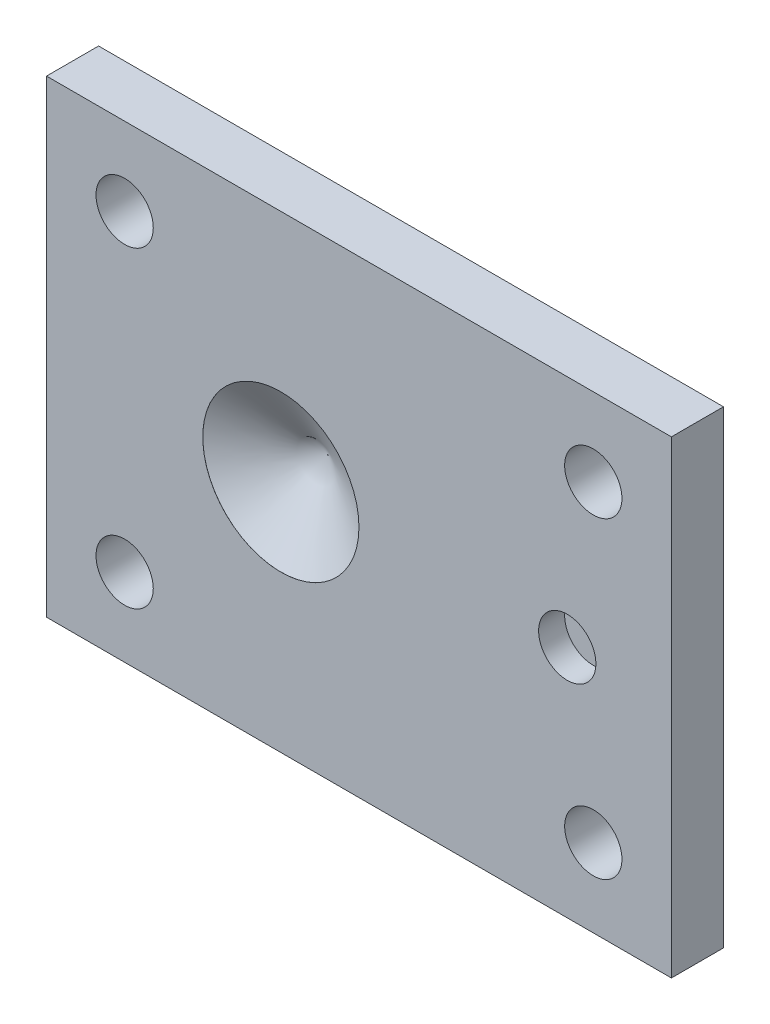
from build123d import *

# Parameters (mm, degrees)
ESQUISSE1_W             = 120
ESQUISSE1_H             = 90
EXTRUSION1_DEPTH        = 10
ESQUISSE2_R             = 5.5
ENL_V_MAT_EXTRU_1_DEPTH = 151.332963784
D_GAGEMENT_M61_D        = 30
D_GAGEMENT_M61_DEPTH    = 0.01
D_GAGEMENT_M61_TIP      = 9.012909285
ESQUISSE6_R             = 5.5
ENL_V_MAT_EXTRU_2_DEPTH = 5


with BuildPart() as part:
    # Esquisse1 → Extrusion1 (new body)
    with BuildSketch(Plane.XY):
        with Locations((60, 45)):
            Rectangle(ESQUISSE1_W, ESQUISSE1_H)
    extrude(amount=EXTRUSION1_DEPTH)

    # Esquisse2 → Enl_v. mat.-Extru.1 (cut, through all)
    with BuildSketch(Plane.XY.offset(10)):
        with Locations((15, 75)):
            Circle(ESQUISSE2_R)
        with Locations((105, 75)):
            Circle(ESQUISSE2_R)
        with Locations((105, 15)):
            Circle(ESQUISSE2_R)
        with Locations((15, 15)):
            Circle(ESQUISSE2_R)
    extrude(amount=-ENL_V_MAT_EXTRU_1_DEPTH, mode=Mode.SUBTRACT)

    # D_gagement M61
    with Locations(Plane(origin=(45, 45, 10), x_dir=(1, 0, 0), z_dir=(0, 0, 1))):
        with Locations((0, 0)):
            Hole(D_GAGEMENT_M61_D / 2, depth=D_GAGEMENT_M61_DEPTH)
            with Locations((0, 0, -(D_GAGEMENT_M61_DEPTH + D_GAGEMENT_M61_TIP / 2))):  # 118° drill point
                Cone(0, D_GAGEMENT_M61_D / 2, D_GAGEMENT_M61_TIP, mode=Mode.SUBTRACT)

    # Esquisse6 → Enl_v. mat.-Extru.2 (cut)
    with BuildSketch(Plane.XY.offset(10)):
        with Locations((100, 45)):
            Circle(ESQUISSE6_R)
    extrude(amount=-ENL_V_MAT_EXTRU_2_DEPTH, mode=Mode.SUBTRACT)


solid = part.part
